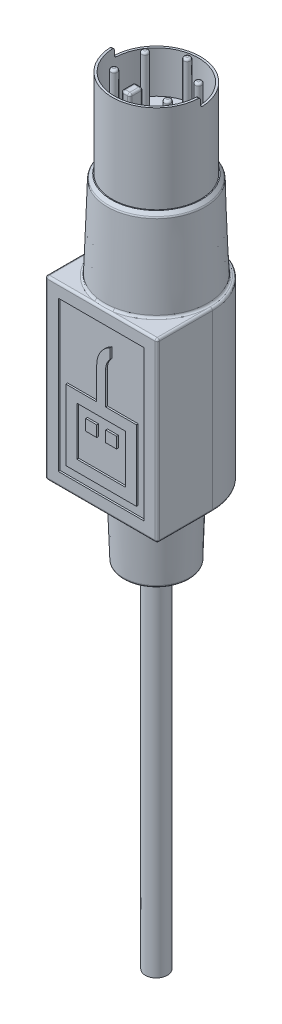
from build123d import *

# Parameters (mm, degrees)
SKETCH1_R               = 6.35
EXTRUDE1_DEPTH          = 12.7
SHELL1_T                = -0.3175
CUT_EXTRUDE1_DEPTH      = 16.554259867
CUT_EXTRUDE1_DEPTH_BACK = 16.554259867
SKETCH2_W               = 6.35
SKETCH2_H               = 1.27
SKETCH3_R               = 0.47625
SKETCH3_W               = 1.27
SKETCH3_H               = 1.905
EXTRUDE2_DEPTH          = 12.065
FILLET2_R               = 0.3175
SKETCH4_R               = 6.985
EXTRUDE5_DEPTH          = 12.7
EXTRUDE5_DRAFT          = -2
CHAMFER1_SIZE           = 0.508
CHAMFER1_SIZE2          = 0.526702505
EXTRUDE6_DEPTH          = 25.4
FILLET8_R               = 0.3175
FILLET9_R               = 0.3175
FILLET10_R              = 0.3175
SKETCH6_R               = 6.0325
EXTRUDE7_DEPTH          = 5.08
SKETCH7_R               = 5.08
EXTRUDE8_DEPTH          = 10.16
EXTRUDE8_TAPER          = 2
FILLET11_R              = 0.3175
SKETCH8_W               = 12.316987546
SKETCH8_H               = 21.59
SKETCH8_W_2             = 6.985
SKETCH8_H_2             = 6.985
SKETCH8_W_3             = 1.5875
SKETCH8_H_3             = 1.5875
CUT_EXTRUDE2_DEPTH      = 0.254
SKETCH9_R               = 1.5875
EXTRUDE9_DEPTH          = 50.8
FILLET12_R              = 0.3175


with BuildPart() as part:
    # Sketch1 → Extrude1 (new body)
    with BuildSketch(Plane(origin=(0, 0, 0), x_dir=(1, 0, 0), z_dir=(0, 1, 0))):
        with Locations(Location((0, 0, 0), (0, 0, 270))):
            Circle(SKETCH1_R)
    extrude(amount=EXTRUDE1_DEPTH)

    # Shell1
    shell1_openings = [part.faces().sort_by_distance(p)[0] for p in [
        (0, 12.7, 0),
    ]]
    offset(amount=SHELL1_T, openings=shell1_openings, kind=Kind.INTERSECTION)

    # Sketch2 → Cut-Extrude1 (cut, two sides: drawn at the far end of the back side and taken through both)
    with BuildSketch(Plane(origin=(0, 0, 0), x_dir=(0, 0, -1), z_dir=(1, 0, 0)).offset(-CUT_EXTRUDE1_DEPTH_BACK)):
        with Locations((3.175, 12.065)):
            Rectangle(SKETCH2_W, SKETCH2_H)
    extrude(amount=CUT_EXTRUDE1_DEPTH + CUT_EXTRUDE1_DEPTH_BACK, mode=Mode.SUBTRACT)

    # Sketch3 → Extrude2 (add)
    with BuildSketch(Plane(origin=(0, 0.3175, 0), x_dir=(-1, 0, 0), z_dir=(0, 1, 0))):
        with Locations(Location((3.84948292, 2.2225, 0), (0, 0, 90))):
            Circle(SKETCH3_R)
        with Locations(Location((3.84948292, -2.2225, 0), (0, 0, 90))):
            Circle(SKETCH3_R)
        with Locations(Location((0, -4.445, 0), (0, 0, 90))):
            Circle(SKETCH3_R)
        with Locations(Location((-3.84948292, -2.2225, 0), (0, 0, 90))):
            Circle(SKETCH3_R)
        with Locations(Location((-3.84948292, 2.2225, 0), (0, 0, 90))):
            Circle(SKETCH3_R)
        with Locations((0, 3.4925)):
            Rectangle(SKETCH3_W, SKETCH3_H)
    extrude(amount=EXTRUDE2_DEPTH)

    # Fillet2
    fillet2_edges = [part.edges().sort_by_distance(p)[0] for p in [
        (-6.19125, 11.43, 0),
        (6.19125, 12.7, 0),
        (-6.19125, 12.7, 0),
        (6.19125, 11.43, 0),
        (0.635, 6.35, 4.445),
        (0.635, 6.35, 2.54),
        (-0.635, 6.35, 2.54),
        (-0.635, 6.35, 4.445),
        (0.635, 12.3825, 3.4925),
        (0, 12.3825, 2.54),
        (-0.635, 12.3825, 3.4925),
        (0, 12.3825, 4.445),
        (-3.84948292, 12.3825, 1.74625),
        (-3.84948292, 12.3825, -2.69875),
        (0, 12.3825, -4.92125),
        (3.84948292, 12.3825, -2.69875),
        (3.84948292, 12.3825, 1.74625),
    ]]
    fillet(fillet2_edges, radius=FILLET2_R)


with BuildPart() as extrude5_tool:
    # Sketch4 → Extrude5 (with draft: the straight prism first)
    with BuildSketch(Plane.XZ):
        Circle(SKETCH4_R)
    extrude(amount=EXTRUDE5_DEPTH)
    # Extrude5: the draft: its side faces are tilted about the plane it starts from
    extrude5_sides = [extrude5_tool.faces().sort_by_distance(p)[0] for p in [
        (-6.985, -6.35, 0),
    ]]
    draft(extrude5_sides, Plane.XZ, EXTRUDE5_DRAFT)


with BuildPart() as part_1:
    add(part.part)

    # Extrude5: add extrude5_tool
    add(extrude5_tool.part)

    # Chamfer1
    chamfer1_edges = [part_1.edges().sort_by_distance(p)[0] for p in [
        (-6.985, 0, 0),
    ]]
    chamfer1_side = [part_1.faces().sort_by_distance(p)[0] for p in [
        (-6.787434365, 0, 0),
    ]]
    chamfer(chamfer1_edges, length=CHAMFER1_SIZE, length2=CHAMFER1_SIZE2, reference=chamfer1_side[0])

    # Sketch5 → Extrude6 (add)
    with BuildSketch(Plane.XZ.offset(12.7)):
        with BuildLine():
            Line((8.063493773, 0), (8.063493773, 7.9375))
            Line((8.063493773, 7.9375), (-8.063493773, 7.9375))
            Line((-8.063493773, 7.9375), (-8.063493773, 0))
            ThreePointArc((-8.063493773, 0), (0, -8.063493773), (8.063493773, 0))
        make_face()
    extrude(amount=EXTRUDE6_DEPTH)

    # Fillet8
    fillet8_edges = [part_1.edges().sort_by_distance(p)[0] for p in [
        (0, -12.7, -8.063493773),
        (8.063493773, -12.7, 3.96875),
        (-8.063493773, -12.7, 3.96875),
    ]]
    fillet(fillet8_edges, radius=FILLET8_R)

    # Fillet9
    fillet9_edges = [part_1.edges().sort_by_distance(p)[0] for p in [
        (8.063493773, -25.55875, 7.9375),
        (-8.063493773, -25.55875, 7.9375),
        (0, -12.7, 7.9375),
        (7.970500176, -12.792993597, 7.9375),
        (-7.970500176, -12.792993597, 7.9375),
    ]]
    fillet(fillet9_edges, radius=FILLET9_R)

    # Fillet10
    fillet10_edges = [part_1.edges().sort_by_distance(p)[0] for p in [
        (-7.428493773, -12.7, 0),
        (-7.003381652, -0.526381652, 0),
    ]]
    fillet(fillet10_edges, radius=FILLET10_R)

    # Sketch6 → Extrude7 (add)
    with BuildSketch(Plane(origin=(0, 0.3175, 0), x_dir=(-1, 0, 0), z_dir=(0, 1, 0))):
        with Locations(Location((0, 0, 0), (0, 0, 356.98303869))):
            Circle(SKETCH6_R)
    extrude(amount=EXTRUDE7_DEPTH)

    # Sketch7 → Extrude8 (add)
    with BuildSketch(Plane.XZ.offset(38.1)):
        Circle(SKETCH7_R)
    extrude(amount=EXTRUDE8_DEPTH, taper=EXTRUDE8_TAPER)

    # Fillet11
    fillet11_edges = [part_1.edges().sort_by_distance(p)[0] for p in [
        (0, -38.1, -8.063493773),
        (8.063493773, -38.1, 3.81),
        (0, -38.1, 7.9375),
        (-8.063493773, -38.1, 3.81),
        (-7.970500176, -38.1, 7.844506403),
        (7.970500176, -38.1, 7.844506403),
        (-5.08, -38.1, 0),
    ]]
    fillet(fillet11_edges, radius=FILLET11_R)

    # Sketch8 → Cut-Extrude2 (cut)
    # profile 1 of 2: a face of its own
    with BuildSketch(Plane.XY.offset(7.9375)):
        with Locations((0, -25.4)):
            Rectangle(SKETCH8_W, SKETCH8_H)
        with BuildLine():
            ThreePointArc((-0.635, -20.121853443), (-0.114315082, -18.312204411), (1.288499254, -17.055998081))
            Line((1.288499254, -17.055998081), (1.288499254, -18.53280799))
            ThreePointArc((1.288499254, -18.53280799), (0.804753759, -19.26276574), (0.635, -20.121853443))
            Line((0.635, -20.121853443), (0.635, -24.765))
            Line((0.635, -24.765), (5.08, -24.765))
            Line((5.08, -24.765), (5.08, -34.925))
            Line((5.08, -34.925), (-5.08, -34.925))
            Line((-5.08, -34.925), (-5.08, -24.765))
            Line((-5.08, -24.765), (-0.635, -24.765))
            Line((-0.635, -24.765), (-0.635, -20.121853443))
        make_face(mode=Mode.SUBTRACT)
    # profile 2 of 2: a face of its own
    with BuildSketch(Plane.XY.offset(7.9375)):
        with Locations((0, -29.845)):
            Rectangle(SKETCH8_W_2, SKETCH8_H_2)
        with Locations((-1.42875, -28.41625)):
            Rectangle(SKETCH8_W_3, SKETCH8_H_3, mode=Mode.SUBTRACT)
        with Locations((1.42875, -28.41625)):
            Rectangle(SKETCH8_W_3, SKETCH8_H_3, mode=Mode.SUBTRACT)
    extrude(amount=-CUT_EXTRUDE2_DEPTH, mode=Mode.SUBTRACT)

    # Sketch9 → Extrude9 (add)
    with BuildSketch(Plane.XZ.offset(48.26)):
        with Locations(Location((0, 0, 0), (0, 0, 270))):
            Circle(SKETCH9_R)
    extrude(amount=EXTRUDE9_DEPTH)

    # Fillet12
    fillet12_edges = [part_1.edges().sort_by_distance(p)[0] for p in [
        (-4.725204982, -48.26, 0),
    ]]
    fillet(fillet12_edges, radius=FILLET12_R)


solid = part_1.part
